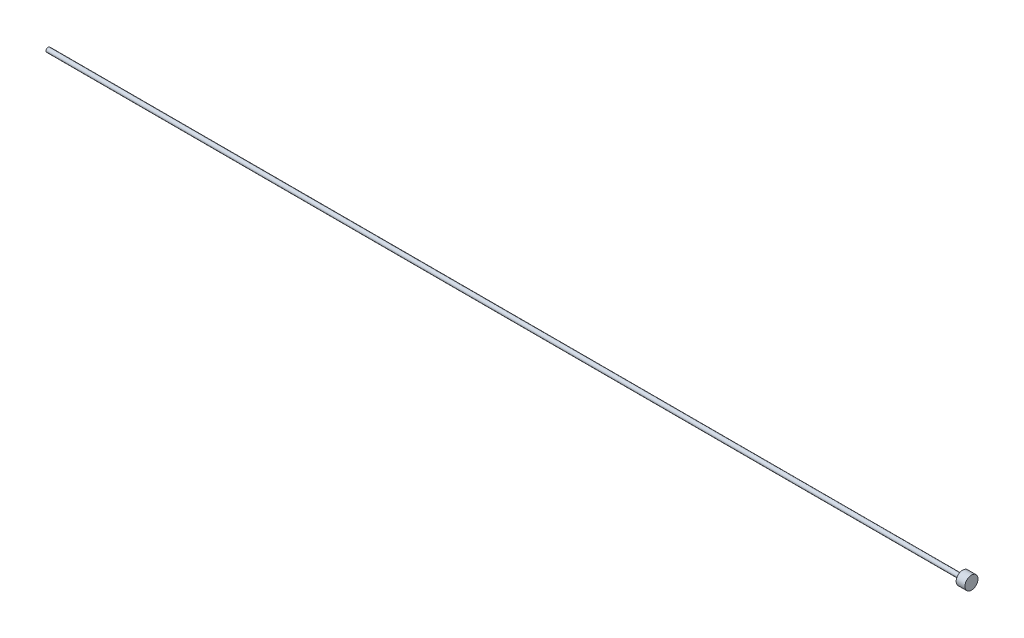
from build123d import *

# Parameters (mm, degrees)
SKETCH2_R               = 3.175
MAIN_BODY_DEPTH         = 1340.2945
SKETCH3_R               = 9.525
PISTON_SIMULATION_DEPTH = 12.7
CHAMFER1_SIZE           = 0.508


with BuildPart() as part:
    # Sketch2 → Main_body (new body)
    with BuildSketch(Plane.ZY.offset(-1644.184351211)):
        Circle(SKETCH2_R)
    extrude(amount=MAIN_BODY_DEPTH)

    # Sketch3 → Piston Simulation (add)
    with BuildSketch(Plane.ZY.offset(-1644.184351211)):
        Circle(SKETCH3_R)
    extrude(amount=PISTON_SIMULATION_DEPTH)

    # Chamfer1
    chamfer1_edges = [part.edges().sort_by_distance(p)[0] for p in [
        (303.889851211, 0, -3.175),
    ]]
    chamfer(chamfer1_edges, length=CHAMFER1_SIZE)


solid = part.part
